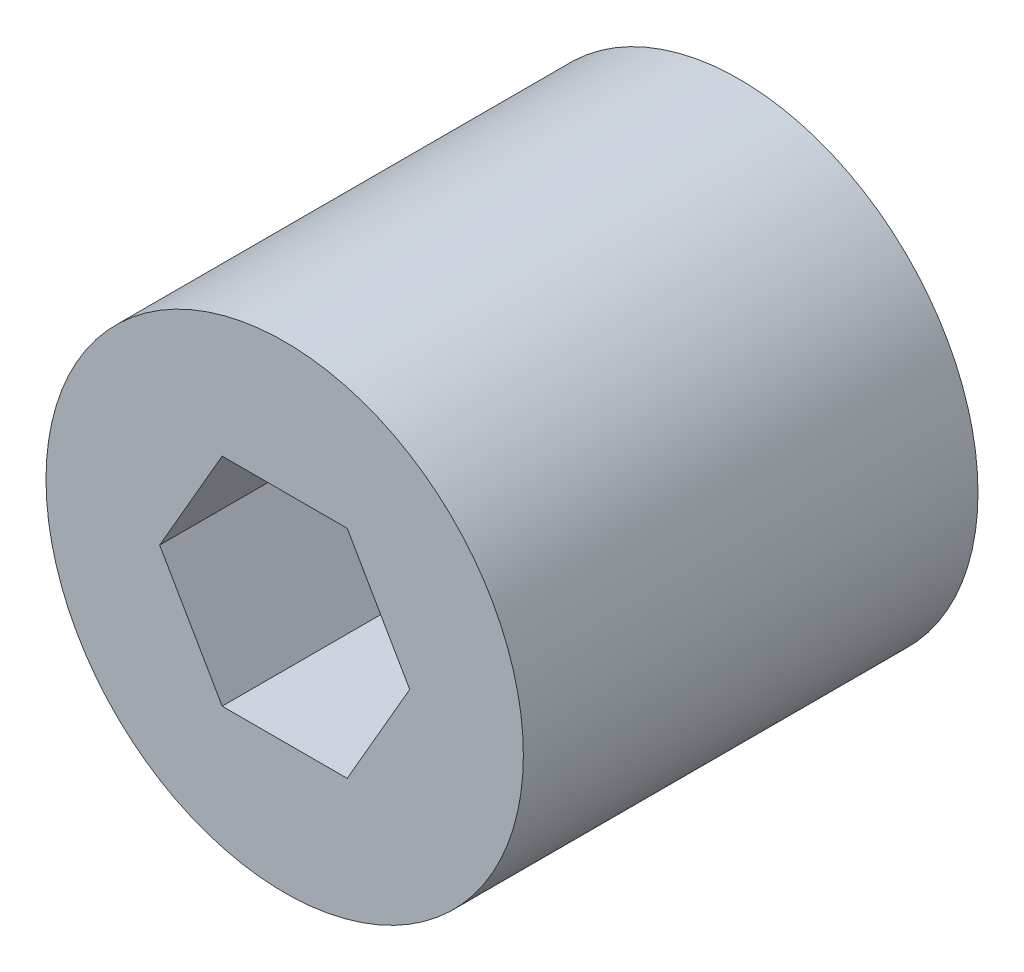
ISO-10303-21;
HEADER;
FILE_DESCRIPTION(('STEP AP214'),'2;1');
FILE_NAME('part.step','',(''),(''),'','','');
FILE_SCHEMA(('AUTOMOTIVE_DESIGN { 1 0 10303 214 1 1 1 1 }'));
ENDSEC;
DATA;
#1=APPLICATION_CONTEXT('core data for automotive mechanical design processes');
#2=APPLICATION_PROTOCOL_DEFINITION('international standard','automotive_design',2000,#1);
#3=PRODUCT_CONTEXT('',#1,'mechanical');
#4=PRODUCT('Part','Part','',(#3));
#5=PRODUCT_RELATED_PRODUCT_CATEGORY('part','',(#4));
#6=PRODUCT_DEFINITION_FORMATION('','',#4);
#7=PRODUCT_DEFINITION_CONTEXT('part definition',#1,'design');
#8=PRODUCT_DEFINITION('design','',#6,#7);
#9=PRODUCT_DEFINITION_SHAPE('','',#8);
#10=(LENGTH_UNIT() NAMED_UNIT(*) SI_UNIT(.MILLI.,.METRE.));
#11=(NAMED_UNIT(*) PLANE_ANGLE_UNIT() SI_UNIT($,.RADIAN.));
#12=(NAMED_UNIT(*) SI_UNIT($,.STERADIAN.) SOLID_ANGLE_UNIT());
#13=UNCERTAINTY_MEASURE_WITH_UNIT(LENGTH_MEASURE(1.E-05),#10,'distance_accuracy_value','');
#14=(GEOMETRIC_REPRESENTATION_CONTEXT(3) GLOBAL_UNCERTAINTY_ASSIGNED_CONTEXT((#13)) GLOBAL_UNIT_ASSIGNED_CONTEXT((#10,
#11,#12)) REPRESENTATION_CONTEXT('',''));
#15=CARTESIAN_POINT('',(0.,0.,0.));
#16=DIRECTION('',(0.,0.,1.));
#17=DIRECTION('',(1.,0.,0.));
#18=AXIS2_PLACEMENT_3D('',#15,#16,#17);
#19=CARTESIAN_POINT('',(42.09,32.086,31.7687999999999));
#20=DIRECTION('',(0.,0.,1.));
#21=DIRECTION('',(1.,0.,0.));
#22=AXIS2_PLACEMENT_3D('',#19,#20,#21);
#23=PLANE('',#22);
#24=DIRECTION('',(0.499999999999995,-0.866025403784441,0.));
#25=VECTOR('',#24,1.);
#26=CARTESIAN_POINT('',(41.3915,30.8761625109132,31.7687999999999));
#27=LINE('',#26,#25);
#28=CARTESIAN_POINT('',(40.693,32.086,31.7687999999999));
#29=VERTEX_POINT('',#28);
#30=CARTESIAN_POINT('',(41.3915,30.8761625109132,31.7687999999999));
#31=VERTEX_POINT('',#30);
#32=EDGE_CURVE('E73',#29,#31,#27,.T.);
#33=ORIENTED_EDGE('',*,*,#32,.T.);
#34=DIRECTION('',(1.,0.,0.));
#35=VECTOR('',#34,1.);
#36=CARTESIAN_POINT('',(42.7885,30.8761625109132,31.7687999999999));
#37=LINE('',#36,#35);
#38=CARTESIAN_POINT('',(42.7885,30.8761625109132,31.7687999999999));
#39=VERTEX_POINT('',#38);
#40=EDGE_CURVE('E75',#31,#39,#37,.T.);
#41=ORIENTED_EDGE('',*,*,#40,.T.);
#42=DIRECTION('',(0.499999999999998,0.86602540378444,0.));
#43=VECTOR('',#42,1.);
#44=CARTESIAN_POINT('',(43.487,32.086,31.7687999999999));
#45=LINE('',#44,#43);
#46=CARTESIAN_POINT('',(43.487,32.086,31.7687999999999));
#47=VERTEX_POINT('',#46);
#48=EDGE_CURVE('E60',#39,#47,#45,.T.);
#49=ORIENTED_EDGE('',*,*,#48,.T.);
#50=DIRECTION('',(-0.499999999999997,0.866025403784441,0.));
#51=VECTOR('',#50,1.);
#52=CARTESIAN_POINT('',(42.7885,33.2958374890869,31.7687999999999));
#53=LINE('',#52,#51);
#54=CARTESIAN_POINT('',(42.7885,33.2958374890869,31.7687999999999));
#55=VERTEX_POINT('',#54);
#56=EDGE_CURVE('E98',#47,#55,#53,.T.);
#57=ORIENTED_EDGE('',*,*,#56,.T.);
#58=DIRECTION('',(1.,0.,0.));
#59=VECTOR('',#58,1.);
#60=CARTESIAN_POINT('',(41.3915,33.2958374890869,31.7687999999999));
#61=LINE('',#60,#59);
#62=CARTESIAN_POINT('',(41.3915,33.2958374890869,31.7687999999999));
#63=VERTEX_POINT('',#62);
#64=EDGE_CURVE('E94',#55,#63,#61,.F.);
#65=ORIENTED_EDGE('',*,*,#64,.T.);
#66=DIRECTION('',(-0.499999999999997,-0.86602540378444,0.));
#67=VECTOR('',#66,1.);
#68=CARTESIAN_POINT('',(40.693,32.086,31.7687999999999));
#69=LINE('',#68,#67);
#70=EDGE_CURVE('E77',#63,#29,#69,.T.);
#71=ORIENTED_EDGE('',*,*,#70,.T.);
#72=EDGE_LOOP('',(#33,#41,#49,#57,#65,#71));
#73=FACE_BOUND('',#72,.T.);
#74=ADVANCED_FACE('F16',(#73),#23,.T.);
#75=CARTESIAN_POINT('',(42.7885,30.8761625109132,31.7687999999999));
#76=DIRECTION('',(0.,-1.,0.));
#77=DIRECTION('',(0.,0.,-1.));
#78=AXIS2_PLACEMENT_3D('',#75,#76,#77);
#79=PLANE('',#78);
#80=DIRECTION('',(0.,0.,1.));
#81=VECTOR('',#80,1.);
#82=CARTESIAN_POINT('',(42.7885,30.8761625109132,31.7687999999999));
#83=LINE('',#82,#81);
#84=CARTESIAN_POINT('',(42.7885,30.8761625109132,34.3087999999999));
#85=VERTEX_POINT('',#84);
#86=EDGE_CURVE('E85',#85,#39,#83,.F.);
#87=ORIENTED_EDGE('',*,*,#86,.T.);
#88=ORIENTED_EDGE('',*,*,#40,.F.);
#89=DIRECTION('',(0.,0.,1.));
#90=VECTOR('',#89,1.);
#91=CARTESIAN_POINT('',(41.3915,30.8761625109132,31.7687999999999));
#92=LINE('',#91,#90);
#93=CARTESIAN_POINT('',(41.3915,30.8761625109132,34.3087999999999));
#94=VERTEX_POINT('',#93);
#95=EDGE_CURVE('E81',#31,#94,#92,.T.);
#96=ORIENTED_EDGE('',*,*,#95,.T.);
#97=DIRECTION('',(1.,0.,0.));
#98=VECTOR('',#97,1.);
#99=CARTESIAN_POINT('',(41.8475454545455,30.8761625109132,34.3088));
#100=LINE('',#99,#98);
#101=EDGE_CURVE('E53',#85,#94,#100,.F.);
#102=ORIENTED_EDGE('',*,*,#101,.F.);
#103=EDGE_LOOP('',(#87,#88,#96,#102));
#104=FACE_BOUND('',#103,.T.);
#105=ADVANCED_FACE('F83',(#104),#79,.F.);
#106=CARTESIAN_POINT('',(41.3915,30.8761625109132,31.7687999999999));
#107=DIRECTION('',(-0.866025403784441,-0.499999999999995,0.));
#108=DIRECTION('',(0.499999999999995,-0.866025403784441,0.));
#109=AXIS2_PLACEMENT_3D('',#106,#107,#108);
#110=PLANE('',#109);
#111=ORIENTED_EDGE('',*,*,#95,.F.);
#112=ORIENTED_EDGE('',*,*,#32,.F.);
#113=DIRECTION('',(0.,0.,1.));
#114=VECTOR('',#113,1.);
#115=CARTESIAN_POINT('',(40.693,32.086,31.7687999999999));
#116=LINE('',#115,#114);
#117=CARTESIAN_POINT('',(40.693,32.086,34.3087999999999));
#118=VERTEX_POINT('',#117);
#119=EDGE_CURVE('E91',#29,#118,#116,.T.);
#120=ORIENTED_EDGE('',*,*,#119,.T.);
#121=DIRECTION('',(-0.49999999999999,0.866025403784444,0.));
#122=VECTOR('',#121,1.);
#123=CARTESIAN_POINT('',(41.3915,30.8761625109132,34.3088));
#124=LINE('',#123,#122);
#125=EDGE_CURVE('E89',#94,#118,#124,.T.);
#126=ORIENTED_EDGE('',*,*,#125,.F.);
#127=EDGE_LOOP('',(#111,#112,#120,#126));
#128=FACE_BOUND('',#127,.T.);
#129=ADVANCED_FACE('F87',(#128),#110,.F.);
#130=CARTESIAN_POINT('',(40.693,32.086,31.7687999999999));
#131=DIRECTION('',(-0.86602540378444,0.499999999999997,0.));
#132=DIRECTION('',(-0.499999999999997,-0.86602540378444,0.));
#133=AXIS2_PLACEMENT_3D('',#130,#131,#132);
#134=PLANE('',#133);
#135=ORIENTED_EDGE('',*,*,#119,.F.);
#136=ORIENTED_EDGE('',*,*,#70,.F.);
#137=DIRECTION('',(0.,0.,1.));
#138=VECTOR('',#137,1.);
#139=CARTESIAN_POINT('',(41.3915,33.2958374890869,31.7687999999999));
#140=LINE('',#139,#138);
#141=CARTESIAN_POINT('',(41.3915,33.2958374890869,34.3087999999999));
#142=VERTEX_POINT('',#141);
#143=EDGE_CURVE('E96',#63,#142,#140,.T.);
#144=ORIENTED_EDGE('',*,*,#143,.T.);
#145=DIRECTION('',(0.499999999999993,0.866025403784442,0.));
#146=VECTOR('',#145,1.);
#147=CARTESIAN_POINT('',(40.693,32.086,34.3088));
#148=LINE('',#147,#146);
#149=EDGE_CURVE('E115',#118,#142,#148,.T.);
#150=ORIENTED_EDGE('',*,*,#149,.F.);
#151=EDGE_LOOP('',(#135,#136,#144,#150));
#152=FACE_BOUND('',#151,.T.);
#153=ADVANCED_FACE('F193',(#152),#134,.F.);
#154=CARTESIAN_POINT('',(41.3915,33.2958374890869,31.7687999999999));
#155=DIRECTION('',(0.,1.,0.));
#156=DIRECTION('',(0.,0.,1.));
#157=AXIS2_PLACEMENT_3D('',#154,#155,#156);
#158=PLANE('',#157);
#159=ORIENTED_EDGE('',*,*,#143,.F.);
#160=ORIENTED_EDGE('',*,*,#64,.F.);
#161=DIRECTION('',(0.,0.,1.));
#162=VECTOR('',#161,1.);
#163=CARTESIAN_POINT('',(42.7885,33.2958374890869,31.7687999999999));
#164=LINE('',#163,#162);
#165=CARTESIAN_POINT('',(42.7885,33.2958374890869,34.3087999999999));
#166=VERTEX_POINT('',#165);
#167=EDGE_CURVE('E100',#55,#166,#164,.T.);
#168=ORIENTED_EDGE('',*,*,#167,.T.);
#169=DIRECTION('',(1.,0.,0.));
#170=VECTOR('',#169,1.);
#171=CARTESIAN_POINT('',(41.8475454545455,33.2958374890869,34.3088));
#172=LINE('',#171,#170);
#173=EDGE_CURVE('E112',#142,#166,#172,.T.);
#174=ORIENTED_EDGE('',*,*,#173,.F.);
#175=EDGE_LOOP('',(#159,#160,#168,#174));
#176=FACE_BOUND('',#175,.T.);
#177=ADVANCED_FACE('F135',(#176),#158,.F.);
#178=CARTESIAN_POINT('',(42.7885,33.2958374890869,31.7687999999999));
#179=DIRECTION('',(0.866025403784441,0.499999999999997,0.));
#180=DIRECTION('',(-0.499999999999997,0.866025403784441,0.));
#181=AXIS2_PLACEMENT_3D('',#178,#179,#180);
#182=PLANE('',#181);
#183=ORIENTED_EDGE('',*,*,#167,.F.);
#184=ORIENTED_EDGE('',*,*,#56,.F.);
#185=DIRECTION('',(0.,0.,1.));
#186=VECTOR('',#185,1.);
#187=CARTESIAN_POINT('',(43.487,32.086,31.7687999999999));
#188=LINE('',#187,#186);
#189=CARTESIAN_POINT('',(43.487,32.086,34.3087999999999));
#190=VERTEX_POINT('',#189);
#191=EDGE_CURVE('E33',#47,#190,#188,.T.);
#192=ORIENTED_EDGE('',*,*,#191,.T.);
#193=DIRECTION('',(0.499999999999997,-0.86602540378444,0.));
#194=VECTOR('',#193,1.);
#195=CARTESIAN_POINT('',(42.7885,33.2958374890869,34.3088));
#196=LINE('',#195,#194);
#197=EDGE_CURVE('E109',#166,#190,#196,.T.);
#198=ORIENTED_EDGE('',*,*,#197,.F.);
#199=EDGE_LOOP('',(#183,#184,#192,#198));
#200=FACE_BOUND('',#199,.T.);
#201=ADVANCED_FACE('F126',(#200),#182,.F.);
#202=CARTESIAN_POINT('',(43.487,32.086,31.7687999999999));
#203=DIRECTION('',(0.86602540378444,-0.499999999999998,0.));
#204=DIRECTION('',(0.499999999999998,0.86602540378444,0.));
#205=AXIS2_PLACEMENT_3D('',#202,#203,#204);
#206=PLANE('',#205);
#207=ORIENTED_EDGE('',*,*,#191,.F.);
#208=ORIENTED_EDGE('',*,*,#48,.F.);
#209=ORIENTED_EDGE('',*,*,#86,.F.);
#210=DIRECTION('',(-0.500000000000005,-0.866025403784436,0.));
#211=VECTOR('',#210,1.);
#212=CARTESIAN_POINT('',(43.487,32.086,34.3088));
#213=LINE('',#212,#211);
#214=EDGE_CURVE('E106',#190,#85,#213,.T.);
#215=ORIENTED_EDGE('',*,*,#214,.F.);
#216=EDGE_LOOP('',(#207,#208,#209,#215));
#217=FACE_BOUND('',#216,.T.);
#218=ADVANCED_FACE('F123',(#217),#206,.F.);
#219=CARTESIAN_POINT('',(41.8475454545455,32.0860000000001,29.2287999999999));
#220=DIRECTION('',(0.,0.,1.));
#221=DIRECTION('',(1.,0.,0.));
#222=AXIS2_PLACEMENT_3D('',#219,#220,#221);
#223=PLANE('',#222);
#224=CARTESIAN_POINT('',(42.09,32.086,29.2288));
#225=DIRECTION('',(0.,0.,1.));
#226=DIRECTION('',(1.,0.,0.));
#227=AXIS2_PLACEMENT_3D('',#224,#225,#226);
#228=CIRCLE('',#227,2.667);
#229=CARTESIAN_POINT('',(44.757,32.086,29.2288));
#230=VERTEX_POINT('',#229);
#231=EDGE_CURVE('E20',#230,#230,#228,.T.);
#232=ORIENTED_EDGE('',*,*,#231,.F.);
#233=EDGE_LOOP('',(#232));
#234=FACE_BOUND('',#233,.T.);
#235=ADVANCED_FACE('F125',(#234),#223,.F.);
#236=CARTESIAN_POINT('',(41.8475454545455,32.0860000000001,34.3088));
#237=DIRECTION('',(0.,0.,1.));
#238=DIRECTION('',(1.,0.,0.));
#239=AXIS2_PLACEMENT_3D('',#236,#237,#238);
#240=PLANE('',#239);
#241=ORIENTED_EDGE('',*,*,#197,.T.);
#242=ORIENTED_EDGE('',*,*,#214,.T.);
#243=ORIENTED_EDGE('',*,*,#101,.T.);
#244=ORIENTED_EDGE('',*,*,#125,.T.);
#245=ORIENTED_EDGE('',*,*,#149,.T.);
#246=ORIENTED_EDGE('',*,*,#173,.T.);
#247=EDGE_LOOP('',(#241,#242,#243,#244,#245,#246));
#248=FACE_BOUND('',#247,.T.);
#249=CARTESIAN_POINT('',(42.09,32.086,34.3087999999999));
#250=DIRECTION('',(0.,0.,1.));
#251=DIRECTION('',(1.,0.,0.));
#252=AXIS2_PLACEMENT_3D('',#249,#250,#251);
#253=CIRCLE('',#252,2.667);
#254=CARTESIAN_POINT('',(44.757,32.086,34.3087999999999));
#255=VERTEX_POINT('',#254);
#256=EDGE_CURVE('E11',#255,#255,#253,.F.);
#257=ORIENTED_EDGE('',*,*,#256,.F.);
#258=EDGE_LOOP('',(#257));
#259=FACE_BOUND('',#258,.T.);
#260=ADVANCED_FACE('F120',(#248,#259),#240,.T.);
#261=CARTESIAN_POINT('',(42.09,32.086,29.2288));
#262=DIRECTION('',(0.,0.,1.));
#263=DIRECTION('',(1.,0.,0.));
#264=AXIS2_PLACEMENT_3D('',#261,#262,#263);
#265=CYLINDRICAL_SURFACE('',#264,2.667);
#266=ORIENTED_EDGE('',*,*,#231,.T.);
#267=EDGE_LOOP('',(#266));
#268=FACE_BOUND('',#267,.T.);
#269=ORIENTED_EDGE('',*,*,#256,.T.);
#270=EDGE_LOOP('',(#269));
#271=FACE_BOUND('',#270,.T.);
#272=ADVANCED_FACE('F18',(#268,#271),#265,.T.);
#273=CLOSED_SHELL('',(#74,#105,#129,#153,#177,#201,#218,#235,#260,#272));
#274=MANIFOLD_SOLID_BREP('B1',#273);
#275=ADVANCED_BREP_SHAPE_REPRESENTATION('',(#18,#274),#14);
#276=SHAPE_DEFINITION_REPRESENTATION(#9,#275);
ENDSEC;
END-ISO-10303-21;
